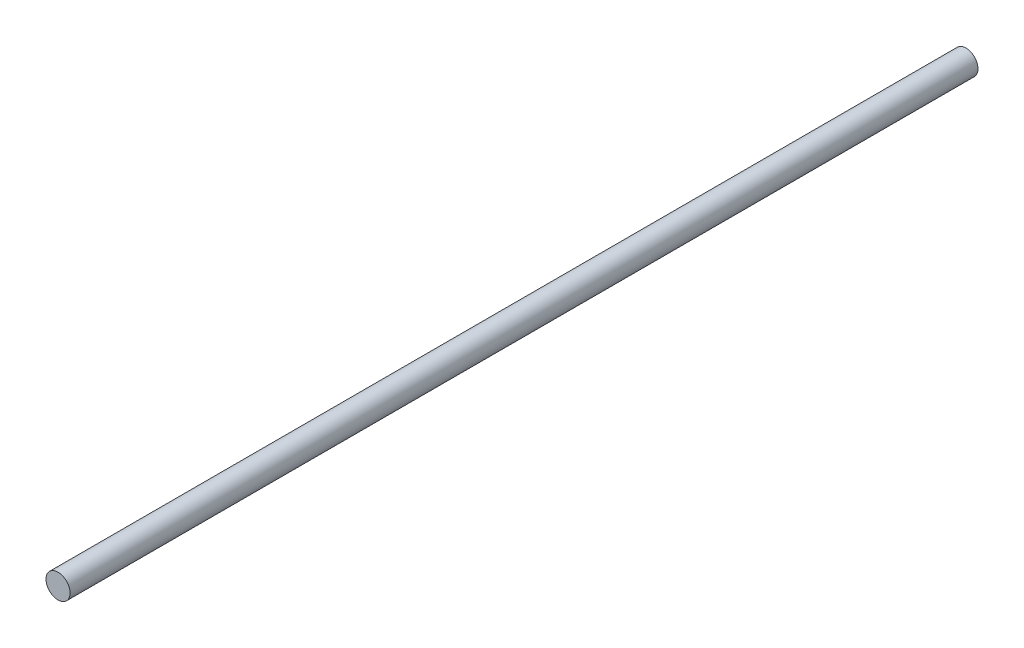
from build123d import *

# Parameters (mm, degrees)
CROQUIS1_R              = 2.5
SALIENTE_EXTRUIR1_DEPTH = 188.4


with BuildPart() as part:
    # Croquis1 → Saliente-Extruir1 (new body)
    with BuildSketch(Plane.XY):
        Circle(CROQUIS1_R)
    extrude(amount=SALIENTE_EXTRUIR1_DEPTH)


solid = part.part
